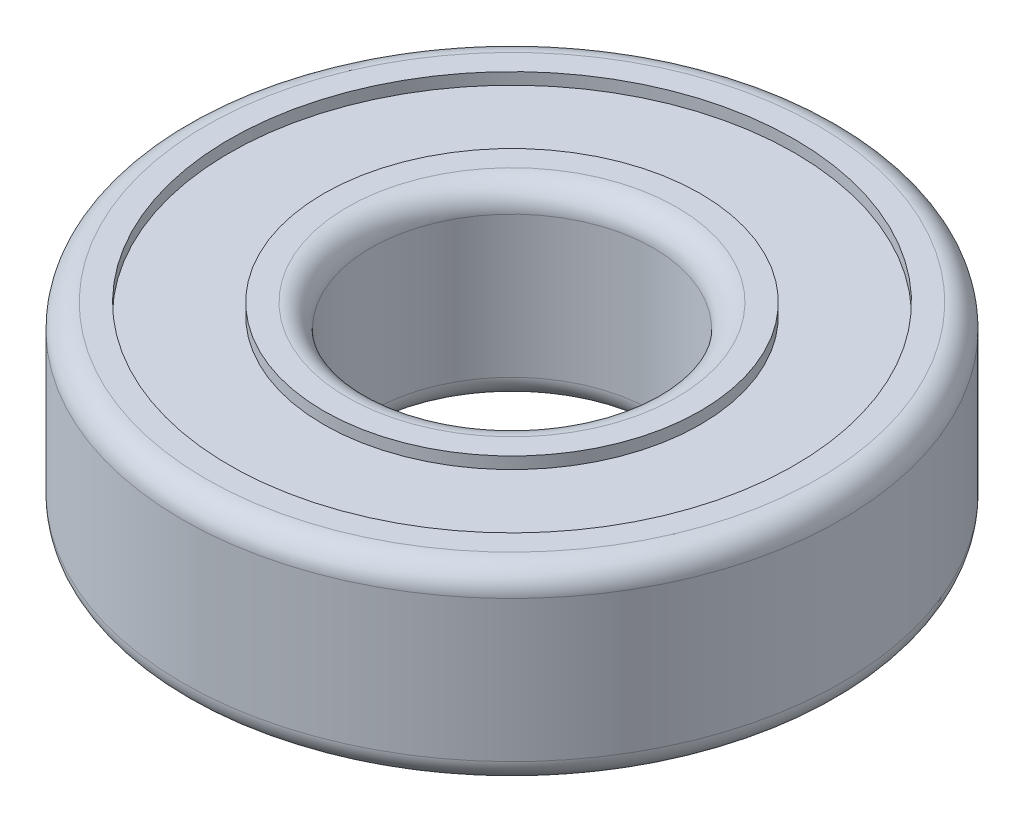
ISO-10303-21;
HEADER;
FILE_DESCRIPTION(('STEP AP214'),'2;1');
FILE_NAME('part.step','',(''),(''),'','','');
FILE_SCHEMA(('AUTOMOTIVE_DESIGN { 1 0 10303 214 1 1 1 1 }'));
ENDSEC;
DATA;
#1=APPLICATION_CONTEXT('core data for automotive mechanical design processes');
#2=APPLICATION_PROTOCOL_DEFINITION('international standard','automotive_design',2000,#1);
#3=PRODUCT_CONTEXT('',#1,'mechanical');
#4=PRODUCT('Part','Part','',(#3));
#5=PRODUCT_RELATED_PRODUCT_CATEGORY('part','',(#4));
#6=PRODUCT_DEFINITION_FORMATION('','',#4);
#7=PRODUCT_DEFINITION_CONTEXT('part definition',#1,'design');
#8=PRODUCT_DEFINITION('design','',#6,#7);
#9=PRODUCT_DEFINITION_SHAPE('','',#8);
#10=(LENGTH_UNIT() NAMED_UNIT(*) SI_UNIT(.MILLI.,.METRE.));
#11=(NAMED_UNIT(*) PLANE_ANGLE_UNIT() SI_UNIT($,.RADIAN.));
#12=(NAMED_UNIT(*) SI_UNIT($,.STERADIAN.) SOLID_ANGLE_UNIT());
#13=UNCERTAINTY_MEASURE_WITH_UNIT(LENGTH_MEASURE(1.E-05),#10,'distance_accuracy_value','');
#14=(GEOMETRIC_REPRESENTATION_CONTEXT(3) GLOBAL_UNCERTAINTY_ASSIGNED_CONTEXT((#13)) GLOBAL_UNIT_ASSIGNED_CONTEXT((#10,
#11,#12)) REPRESENTATION_CONTEXT('',''));
#15=CARTESIAN_POINT('',(0.,0.,0.));
#16=DIRECTION('',(0.,0.,1.));
#17=DIRECTION('',(1.,0.,0.));
#18=AXIS2_PLACEMENT_3D('',#15,#16,#17);
#19=CARTESIAN_POINT('',(0.,-3.,0.));
#20=DIRECTION('',(0.,-1.,0.));
#21=DIRECTION('',(0.,0.,-1.));
#22=AXIS2_PLACEMENT_3D('',#19,#20,#21);
#23=TOROIDAL_SURFACE('',#22,7.,1.);
#24=CARTESIAN_POINT('',(0.,-2.99999999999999,0.));
#25=DIRECTION('',(0.,-1.,0.));
#26=DIRECTION('',(0.,0.,-1.));
#27=AXIS2_PLACEMENT_3D('',#24,#25,#26);
#28=CIRCLE('',#27,6.);
#29=CARTESIAN_POINT('',(0.,-2.99999999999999,-6.));
#30=VERTEX_POINT('',#29);
#31=EDGE_CURVE('E10',#30,#30,#28,.T.);
#32=ORIENTED_EDGE('',*,*,#31,.F.);
#33=EDGE_LOOP('',(#32));
#34=FACE_BOUND('',#33,.T.);
#35=CARTESIAN_POINT('',(0.,-4.,0.));
#36=DIRECTION('',(0.,-1.,0.));
#37=DIRECTION('',(0.,0.,-1.));
#38=AXIS2_PLACEMENT_3D('',#35,#36,#37);
#39=CIRCLE('',#38,7.00000000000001);
#40=CARTESIAN_POINT('',(0.,-4.,-7.00000000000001));
#41=VERTEX_POINT('',#40);
#42=EDGE_CURVE('E84',#41,#41,#39,.T.);
#43=ORIENTED_EDGE('',*,*,#42,.T.);
#44=EDGE_LOOP('',(#43));
#45=FACE_BOUND('',#44,.T.);
#46=ADVANCED_FACE('F32',(#34,#45),#23,.T.);
#47=CARTESIAN_POINT('',(0.,0.,0.));
#48=DIRECTION('',(0.,-1.,0.));
#49=DIRECTION('',(0.,0.,-1.));
#50=AXIS2_PLACEMENT_3D('',#47,#48,#49);
#51=CYLINDRICAL_SURFACE('',#50,6.);
#52=CARTESIAN_POINT('',(0.,2.99999999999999,0.));
#53=DIRECTION('',(0.,-1.,0.));
#54=DIRECTION('',(0.,0.,-1.));
#55=AXIS2_PLACEMENT_3D('',#52,#53,#54);
#56=CIRCLE('',#55,6.);
#57=CARTESIAN_POINT('',(0.,2.99999999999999,-6.));
#58=VERTEX_POINT('',#57);
#59=EDGE_CURVE('E38',#58,#58,#56,.T.);
#60=ORIENTED_EDGE('',*,*,#59,.F.);
#61=EDGE_LOOP('',(#60));
#62=FACE_BOUND('',#61,.T.);
#63=ORIENTED_EDGE('',*,*,#31,.T.);
#64=EDGE_LOOP('',(#63));
#65=FACE_BOUND('',#64,.T.);
#66=ADVANCED_FACE('F169',(#62,#65),#51,.F.);
#67=CARTESIAN_POINT('',(0.,3.,0.));
#68=DIRECTION('',(0.,-1.,0.));
#69=DIRECTION('',(0.,0.,-1.));
#70=AXIS2_PLACEMENT_3D('',#67,#68,#69);
#71=TOROIDAL_SURFACE('',#70,7.,1.);
#72=CARTESIAN_POINT('',(0.,4.,0.));
#73=DIRECTION('',(0.,-1.,0.));
#74=DIRECTION('',(0.,0.,-1.));
#75=AXIS2_PLACEMENT_3D('',#72,#73,#74);
#76=CIRCLE('',#75,7.00000000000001);
#77=CARTESIAN_POINT('',(0.,4.,-7.00000000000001));
#78=VERTEX_POINT('',#77);
#79=EDGE_CURVE('E42',#78,#78,#76,.T.);
#80=ORIENTED_EDGE('',*,*,#79,.F.);
#81=EDGE_LOOP('',(#80));
#82=FACE_BOUND('',#81,.T.);
#83=ORIENTED_EDGE('',*,*,#59,.T.);
#84=EDGE_LOOP('',(#83));
#85=FACE_BOUND('',#84,.T.);
#86=ADVANCED_FACE('F164',(#82,#85),#71,.T.);
#87=CARTESIAN_POINT('',(-7.00000000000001,4.,0.));
#88=DIRECTION('',(0.,-1.,0.));
#89=DIRECTION('',(0.,0.,-1.));
#90=AXIS2_PLACEMENT_3D('',#87,#88,#89);
#91=PLANE('',#90);
#92=CARTESIAN_POINT('',(0.,4.,0.));
#93=DIRECTION('',(0.,-1.,0.));
#94=DIRECTION('',(0.,0.,-1.));
#95=AXIS2_PLACEMENT_3D('',#92,#93,#94);
#96=CIRCLE('',#95,8.);
#97=CARTESIAN_POINT('',(0.,4.,-8.));
#98=VERTEX_POINT('',#97);
#99=EDGE_CURVE('E46',#98,#98,#96,.T.);
#100=ORIENTED_EDGE('',*,*,#99,.F.);
#101=EDGE_LOOP('',(#100));
#102=FACE_BOUND('',#101,.T.);
#103=ORIENTED_EDGE('',*,*,#79,.T.);
#104=EDGE_LOOP('',(#103));
#105=FACE_BOUND('',#104,.T.);
#106=ADVANCED_FACE('F158',(#102,#105),#91,.F.);
#107=CARTESIAN_POINT('',(0.,0.,0.));
#108=DIRECTION('',(0.,-1.,0.));
#109=DIRECTION('',(0.,0.,-1.));
#110=AXIS2_PLACEMENT_3D('',#107,#108,#109);
#111=CYLINDRICAL_SURFACE('',#110,8.);
#112=CARTESIAN_POINT('',(0.,3.5,0.));
#113=DIRECTION('',(0.,-1.,0.));
#114=DIRECTION('',(0.,0.,-1.));
#115=AXIS2_PLACEMENT_3D('',#112,#113,#114);
#116=CIRCLE('',#115,8.);
#117=CARTESIAN_POINT('',(0.,3.5,-8.));
#118=VERTEX_POINT('',#117);
#119=EDGE_CURVE('E51',#118,#118,#116,.T.);
#120=ORIENTED_EDGE('',*,*,#119,.F.);
#121=EDGE_LOOP('',(#120));
#122=FACE_BOUND('',#121,.T.);
#123=ORIENTED_EDGE('',*,*,#99,.T.);
#124=EDGE_LOOP('',(#123));
#125=FACE_BOUND('',#124,.T.);
#126=ADVANCED_FACE('F152',(#122,#125),#111,.T.);
#127=CARTESIAN_POINT('',(-8.,3.5,0.));
#128=DIRECTION('',(0.,-1.,0.));
#129=DIRECTION('',(0.,0.,-1.));
#130=AXIS2_PLACEMENT_3D('',#127,#128,#129);
#131=PLANE('',#130);
#132=CARTESIAN_POINT('',(0.,3.5,0.));
#133=DIRECTION('',(0.,-1.,0.));
#134=DIRECTION('',(0.,0.,-1.));
#135=AXIS2_PLACEMENT_3D('',#132,#133,#134);
#136=CIRCLE('',#135,12.);
#137=CARTESIAN_POINT('',(0.,3.5,-12.));
#138=VERTEX_POINT('',#137);
#139=EDGE_CURVE('E54',#138,#138,#136,.T.);
#140=ORIENTED_EDGE('',*,*,#139,.F.);
#141=EDGE_LOOP('',(#140));
#142=FACE_BOUND('',#141,.T.);
#143=ORIENTED_EDGE('',*,*,#119,.T.);
#144=EDGE_LOOP('',(#143));
#145=FACE_BOUND('',#144,.T.);
#146=ADVANCED_FACE('F146',(#142,#145),#131,.F.);
#147=CARTESIAN_POINT('',(0.,0.,0.));
#148=DIRECTION('',(0.,-1.,0.));
#149=DIRECTION('',(0.,0.,-1.));
#150=AXIS2_PLACEMENT_3D('',#147,#148,#149);
#151=CYLINDRICAL_SURFACE('',#150,12.);
#152=CARTESIAN_POINT('',(0.,4.,0.));
#153=DIRECTION('',(0.,-1.,0.));
#154=DIRECTION('',(0.,0.,-1.));
#155=AXIS2_PLACEMENT_3D('',#152,#153,#154);
#156=CIRCLE('',#155,12.);
#157=CARTESIAN_POINT('',(0.,4.,-12.));
#158=VERTEX_POINT('',#157);
#159=EDGE_CURVE('E57',#158,#158,#156,.T.);
#160=ORIENTED_EDGE('',*,*,#159,.F.);
#161=EDGE_LOOP('',(#160));
#162=FACE_BOUND('',#161,.T.);
#163=ORIENTED_EDGE('',*,*,#139,.T.);
#164=EDGE_LOOP('',(#163));
#165=FACE_BOUND('',#164,.T.);
#166=ADVANCED_FACE('F140',(#162,#165),#151,.F.);
#167=CARTESIAN_POINT('',(-12.,4.,0.));
#168=DIRECTION('',(0.,-1.,0.));
#169=DIRECTION('',(0.,0.,-1.));
#170=AXIS2_PLACEMENT_3D('',#167,#168,#169);
#171=PLANE('',#170);
#172=CARTESIAN_POINT('',(0.,4.,0.));
#173=DIRECTION('',(0.,-1.,0.));
#174=DIRECTION('',(0.,0.,-1.));
#175=AXIS2_PLACEMENT_3D('',#172,#173,#174);
#176=CIRCLE('',#175,13.);
#177=CARTESIAN_POINT('',(0.,4.,-13.));
#178=VERTEX_POINT('',#177);
#179=EDGE_CURVE('E60',#178,#178,#176,.T.);
#180=ORIENTED_EDGE('',*,*,#179,.F.);
#181=EDGE_LOOP('',(#180));
#182=FACE_BOUND('',#181,.T.);
#183=ORIENTED_EDGE('',*,*,#159,.T.);
#184=EDGE_LOOP('',(#183));
#185=FACE_BOUND('',#184,.T.);
#186=ADVANCED_FACE('F134',(#182,#185),#171,.F.);
#187=CARTESIAN_POINT('',(0.,3.,0.));
#188=DIRECTION('',(0.,-1.,0.));
#189=DIRECTION('',(0.,0.,-1.));
#190=AXIS2_PLACEMENT_3D('',#187,#188,#189);
#191=TOROIDAL_SURFACE('',#190,13.,1.);
#192=CARTESIAN_POINT('',(0.,2.99999999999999,0.));
#193=DIRECTION('',(0.,-1.,0.));
#194=DIRECTION('',(0.,0.,-1.));
#195=AXIS2_PLACEMENT_3D('',#192,#193,#194);
#196=CIRCLE('',#195,14.);
#197=CARTESIAN_POINT('',(0.,2.99999999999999,-14.));
#198=VERTEX_POINT('',#197);
#199=EDGE_CURVE('E63',#198,#198,#196,.T.);
#200=ORIENTED_EDGE('',*,*,#199,.F.);
#201=EDGE_LOOP('',(#200));
#202=FACE_BOUND('',#201,.T.);
#203=ORIENTED_EDGE('',*,*,#179,.T.);
#204=EDGE_LOOP('',(#203));
#205=FACE_BOUND('',#204,.T.);
#206=ADVANCED_FACE('F128',(#202,#205),#191,.T.);
#207=CARTESIAN_POINT('',(0.,0.,0.));
#208=DIRECTION('',(0.,-1.,0.));
#209=DIRECTION('',(0.,0.,-1.));
#210=AXIS2_PLACEMENT_3D('',#207,#208,#209);
#211=CYLINDRICAL_SURFACE('',#210,14.);
#212=CARTESIAN_POINT('',(0.,-2.99999999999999,0.));
#213=DIRECTION('',(0.,-1.,0.));
#214=DIRECTION('',(0.,0.,-1.));
#215=AXIS2_PLACEMENT_3D('',#212,#213,#214);
#216=CIRCLE('',#215,14.);
#217=CARTESIAN_POINT('',(0.,-2.99999999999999,-14.));
#218=VERTEX_POINT('',#217);
#219=EDGE_CURVE('E66',#218,#218,#216,.T.);
#220=ORIENTED_EDGE('',*,*,#219,.F.);
#221=EDGE_LOOP('',(#220));
#222=FACE_BOUND('',#221,.T.);
#223=ORIENTED_EDGE('',*,*,#199,.T.);
#224=EDGE_LOOP('',(#223));
#225=FACE_BOUND('',#224,.T.);
#226=ADVANCED_FACE('F122',(#222,#225),#211,.T.);
#227=CARTESIAN_POINT('',(0.,-3.,0.));
#228=DIRECTION('',(0.,-1.,0.));
#229=DIRECTION('',(0.,0.,-1.));
#230=AXIS2_PLACEMENT_3D('',#227,#228,#229);
#231=TOROIDAL_SURFACE('',#230,13.,1.);
#232=CARTESIAN_POINT('',(0.,-4.,0.));
#233=DIRECTION('',(0.,-1.,0.));
#234=DIRECTION('',(0.,0.,-1.));
#235=AXIS2_PLACEMENT_3D('',#232,#233,#234);
#236=CIRCLE('',#235,13.);
#237=CARTESIAN_POINT('',(0.,-4.,-13.));
#238=VERTEX_POINT('',#237);
#239=EDGE_CURVE('E69',#238,#238,#236,.T.);
#240=ORIENTED_EDGE('',*,*,#239,.F.);
#241=EDGE_LOOP('',(#240));
#242=FACE_BOUND('',#241,.T.);
#243=ORIENTED_EDGE('',*,*,#219,.T.);
#244=EDGE_LOOP('',(#243));
#245=FACE_BOUND('',#244,.T.);
#246=ADVANCED_FACE('F116',(#242,#245),#231,.T.);
#247=CARTESIAN_POINT('',(-12.,-4.,0.));
#248=DIRECTION('',(0.,1.,0.));
#249=DIRECTION('',(0.,0.,1.));
#250=AXIS2_PLACEMENT_3D('',#247,#248,#249);
#251=PLANE('',#250);
#252=CARTESIAN_POINT('',(0.,-4.,0.));
#253=DIRECTION('',(0.,-1.,0.));
#254=DIRECTION('',(0.,0.,-1.));
#255=AXIS2_PLACEMENT_3D('',#252,#253,#254);
#256=CIRCLE('',#255,12.);
#257=CARTESIAN_POINT('',(0.,-4.,-12.));
#258=VERTEX_POINT('',#257);
#259=EDGE_CURVE('E72',#258,#258,#256,.T.);
#260=ORIENTED_EDGE('',*,*,#259,.F.);
#261=EDGE_LOOP('',(#260));
#262=FACE_BOUND('',#261,.T.);
#263=ORIENTED_EDGE('',*,*,#239,.T.);
#264=EDGE_LOOP('',(#263));
#265=FACE_BOUND('',#264,.T.);
#266=ADVANCED_FACE('F110',(#262,#265),#251,.F.);
#267=CARTESIAN_POINT('',(0.,0.,0.));
#268=DIRECTION('',(0.,-1.,0.));
#269=DIRECTION('',(0.,0.,-1.));
#270=AXIS2_PLACEMENT_3D('',#267,#268,#269);
#271=CYLINDRICAL_SURFACE('',#270,12.);
#272=CARTESIAN_POINT('',(0.,-3.5,0.));
#273=DIRECTION('',(0.,-1.,0.));
#274=DIRECTION('',(0.,0.,-1.));
#275=AXIS2_PLACEMENT_3D('',#272,#273,#274);
#276=CIRCLE('',#275,12.);
#277=CARTESIAN_POINT('',(0.,-3.5,-12.));
#278=VERTEX_POINT('',#277);
#279=EDGE_CURVE('E75',#278,#278,#276,.T.);
#280=ORIENTED_EDGE('',*,*,#279,.F.);
#281=EDGE_LOOP('',(#280));
#282=FACE_BOUND('',#281,.T.);
#283=ORIENTED_EDGE('',*,*,#259,.T.);
#284=EDGE_LOOP('',(#283));
#285=FACE_BOUND('',#284,.T.);
#286=ADVANCED_FACE('F104',(#282,#285),#271,.F.);
#287=CARTESIAN_POINT('',(-8.,-3.5,0.));
#288=DIRECTION('',(0.,1.,0.));
#289=DIRECTION('',(0.,0.,1.));
#290=AXIS2_PLACEMENT_3D('',#287,#288,#289);
#291=PLANE('',#290);
#292=CARTESIAN_POINT('',(0.,-3.5,0.));
#293=DIRECTION('',(0.,-1.,0.));
#294=DIRECTION('',(0.,0.,-1.));
#295=AXIS2_PLACEMENT_3D('',#292,#293,#294);
#296=CIRCLE('',#295,8.);
#297=CARTESIAN_POINT('',(0.,-3.5,-8.));
#298=VERTEX_POINT('',#297);
#299=EDGE_CURVE('E78',#298,#298,#296,.T.);
#300=ORIENTED_EDGE('',*,*,#299,.F.);
#301=EDGE_LOOP('',(#300));
#302=FACE_BOUND('',#301,.T.);
#303=ORIENTED_EDGE('',*,*,#279,.T.);
#304=EDGE_LOOP('',(#303));
#305=FACE_BOUND('',#304,.T.);
#306=ADVANCED_FACE('F98',(#302,#305),#291,.F.);
#307=CARTESIAN_POINT('',(0.,0.,0.));
#308=DIRECTION('',(0.,-1.,0.));
#309=DIRECTION('',(0.,0.,-1.));
#310=AXIS2_PLACEMENT_3D('',#307,#308,#309);
#311=CYLINDRICAL_SURFACE('',#310,8.);
#312=CARTESIAN_POINT('',(0.,-4.,0.));
#313=DIRECTION('',(0.,-1.,0.));
#314=DIRECTION('',(0.,0.,-1.));
#315=AXIS2_PLACEMENT_3D('',#312,#313,#314);
#316=CIRCLE('',#315,8.);
#317=CARTESIAN_POINT('',(0.,-4.,-8.));
#318=VERTEX_POINT('',#317);
#319=EDGE_CURVE('E81',#318,#318,#316,.T.);
#320=ORIENTED_EDGE('',*,*,#319,.F.);
#321=EDGE_LOOP('',(#320));
#322=FACE_BOUND('',#321,.T.);
#323=ORIENTED_EDGE('',*,*,#299,.T.);
#324=EDGE_LOOP('',(#323));
#325=FACE_BOUND('',#324,.T.);
#326=ADVANCED_FACE('F92',(#322,#325),#311,.T.);
#327=CARTESIAN_POINT('',(-7.00000000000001,-4.,0.));
#328=DIRECTION('',(0.,1.,0.));
#329=DIRECTION('',(0.,0.,1.));
#330=AXIS2_PLACEMENT_3D('',#327,#328,#329);
#331=PLANE('',#330);
#332=ORIENTED_EDGE('',*,*,#42,.F.);
#333=EDGE_LOOP('',(#332));
#334=FACE_BOUND('',#333,.T.);
#335=ORIENTED_EDGE('',*,*,#319,.T.);
#336=EDGE_LOOP('',(#335));
#337=FACE_BOUND('',#336,.T.);
#338=ADVANCED_FACE('F89',(#334,#337),#331,.F.);
#339=CLOSED_SHELL('',(#46,#66,#86,#106,#126,#146,#166,#186,#206,#226,#246,#266,#286,#306,#326,#338));
#340=MANIFOLD_SOLID_BREP('B2',#339);
#341=ADVANCED_BREP_SHAPE_REPRESENTATION('',(#18,#340),#14);
#342=SHAPE_DEFINITION_REPRESENTATION(#9,#341);
ENDSEC;
END-ISO-10303-21;
